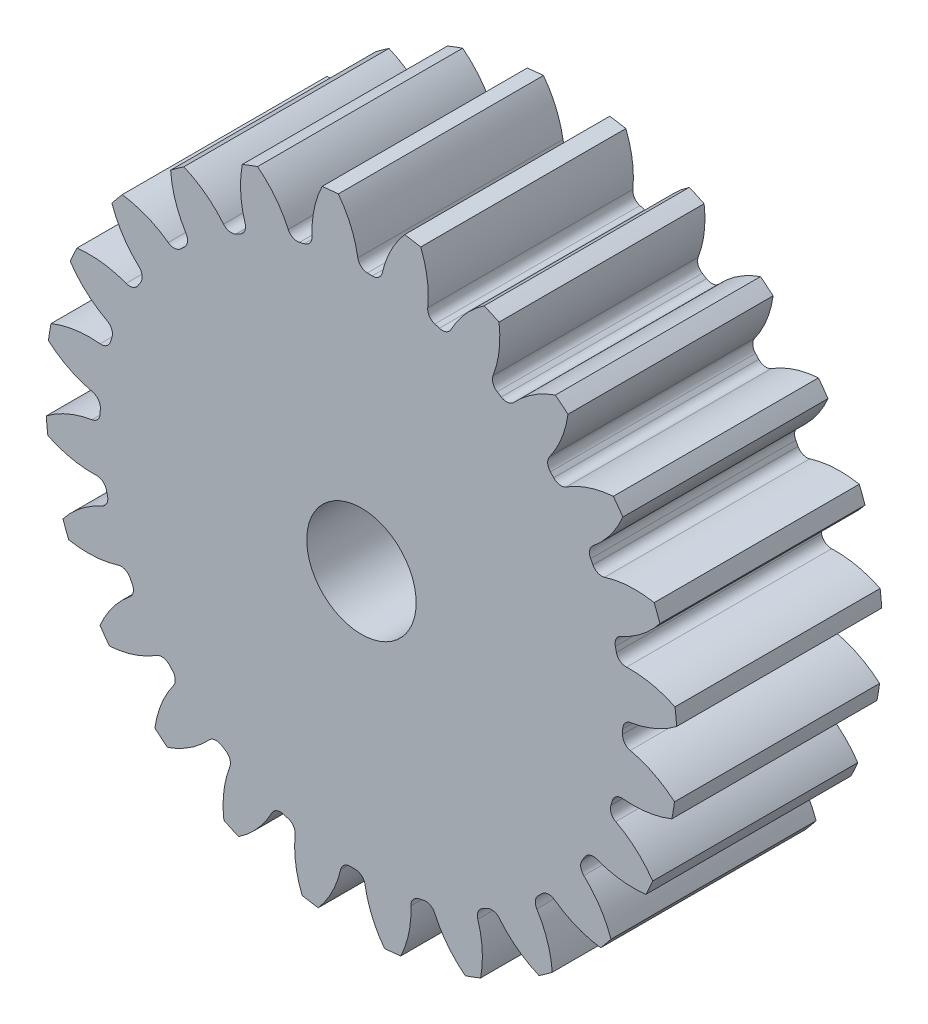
from build123d import *

# Parameters (mm, degrees)
SKETCH3_R         = 146.755555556
GEARBODY_DEPTH    = 95.25
TOOTHCUT_DEPTH    = 229.357063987
CIRPATTERN1_COUNT = 24
BOREDIA_R         = 25.4
BORE_DEPTH        = 12700


with BuildPart() as part:
    # Sketch3 → gearBody (new body)
    with BuildSketch(Plane.XY):
        Circle(SKETCH3_R)
    extrude(amount=GEARBODY_DEPTH)

    # Sketch2 → toothCut (cut, through all)
    with BuildSketch(Plane.XY):
        with BuildLine():
            ThreePointArc((121.252725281, -4.994744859), (121.29366668, -3.875214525), (121.324271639, -2.755353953))
            ThreePointArc((121.324271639, -2.755353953), (122.453967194, 0.159092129), (125.186733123, 1.676391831))
            ThreePointArc((125.186733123, 1.676391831), (136.556855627, 5.000184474), (146.755555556, 11.026277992))
            ThreePointArc((146.755555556, 11.026277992), (147.094141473, -4.699514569), (145.752423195, -20.371623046))
            ThreePointArc((145.752423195, -20.371623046), (135.959185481, -13.706806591), (124.824418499, -9.664004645))
            ThreePointArc((124.824418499, -9.664004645), (122.194079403, -7.97535896), (121.252725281, -4.994744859))
        make_face()
    toothcut = extrude(amount=TOOTHCUT_DEPTH, mode=Mode.SUBTRACT)

    # CirPattern1: toothCut ×24 about axis
    cirpattern1_axis = Axis((0, 0, 0), (0, 0, 1))
    for i in range(1, CIRPATTERN1_COUNT):
        add(toothcut.rotate(cirpattern1_axis, i * 360 / CIRPATTERN1_COUNT), mode=Mode.SUBTRACT)

    # boreDia → bore (cut, symmetric)
    with BuildSketch(Plane.XY):
        Circle(BOREDIA_R)
    extrude(amount=BORE_DEPTH, both=True, mode=Mode.SUBTRACT)


solid = part.part
